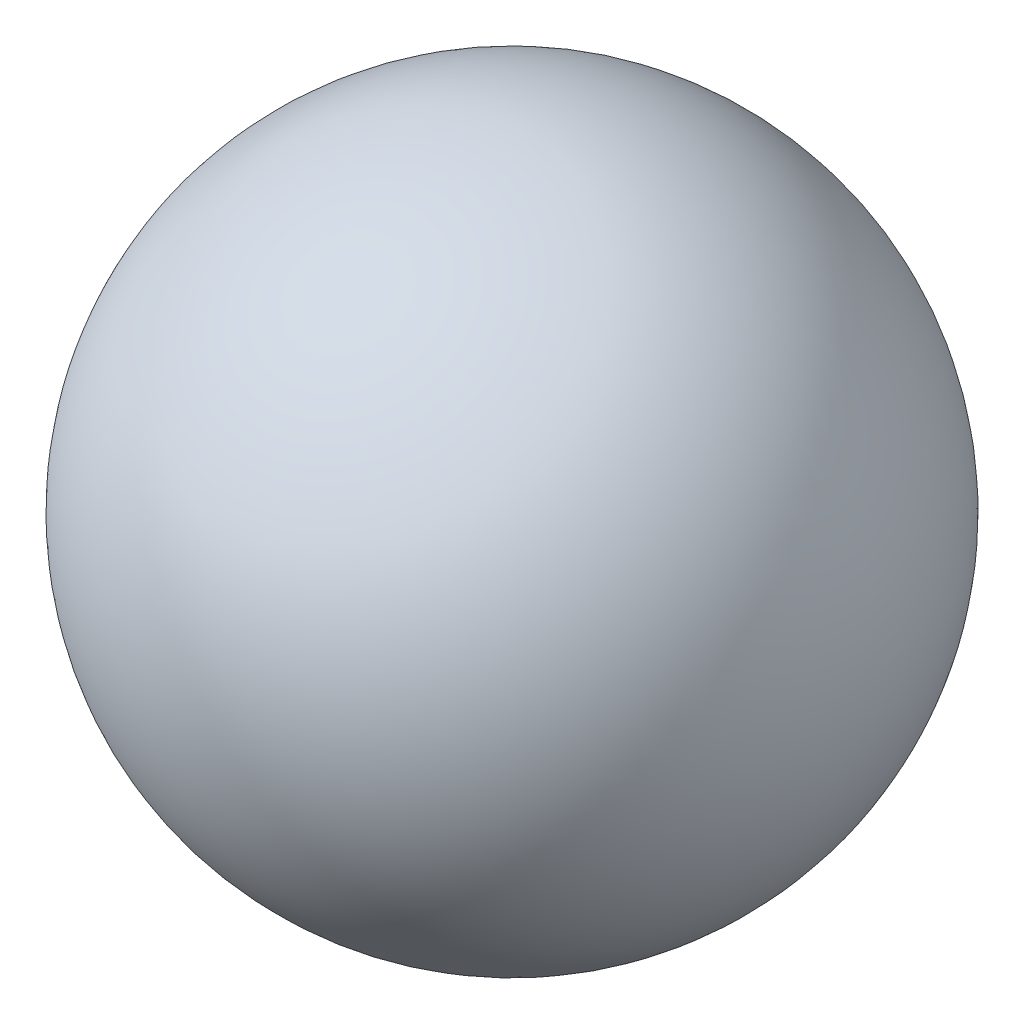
from build123d import *


with BuildPart() as part:
    # Sketch 1 → Revolve 1 (revolve)
    with BuildSketch(Plane(origin=(0, 0, 0), x_dir=(1, 0, 0), z_dir=(0, 1, 0))):
        with BuildLine():
            Line((-1, 0), (1, 0))
            ThreePointArc((1, 0), (0, 1), (-1, 0))
        make_face()
    revolve(axis=Axis((-1, 0, 0), (1, 0, 0)))


solid = part.part
